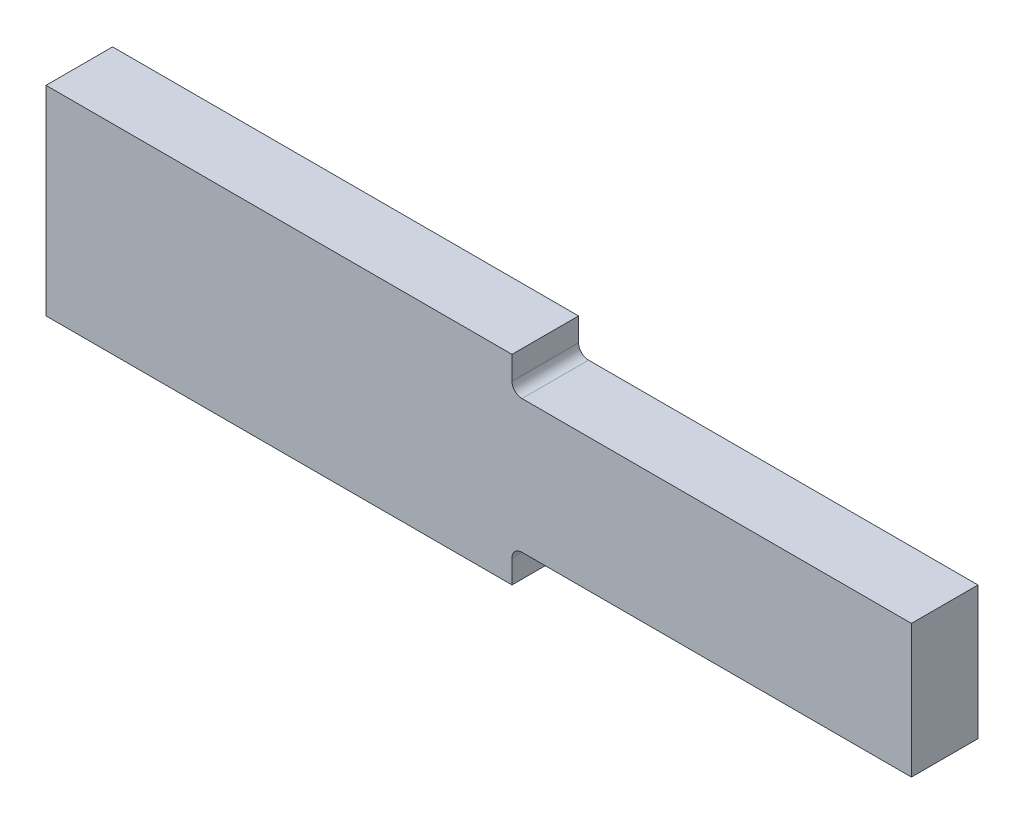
from build123d import *

# Parameters (mm, degrees)
AUFSATZ_LINEAR_AUSTRAGEN1_DEPTH = 20
VERRUNDUNG1_R                   = 3


with BuildPart() as part:
    # Skizze1 → Aufsatz-Linear austragen1 (new body)
    with BuildSketch(Plane.XY):
        Polygon((0, -30), (0, 30), (140, 30), (140, 20), (260, 20), (260, -20), (140, -20), (140, -30), align=None)
    extrude(amount=AUFSATZ_LINEAR_AUSTRAGEN1_DEPTH)

    # Verrundung1
    verrundung1_edges = [part.edges().sort_by_distance(p)[0] for p in [
        (140, 20, 10),
        (140, -20, 10),
    ]]
    fillet(verrundung1_edges, radius=VERRUNDUNG1_R)


solid = part.part
